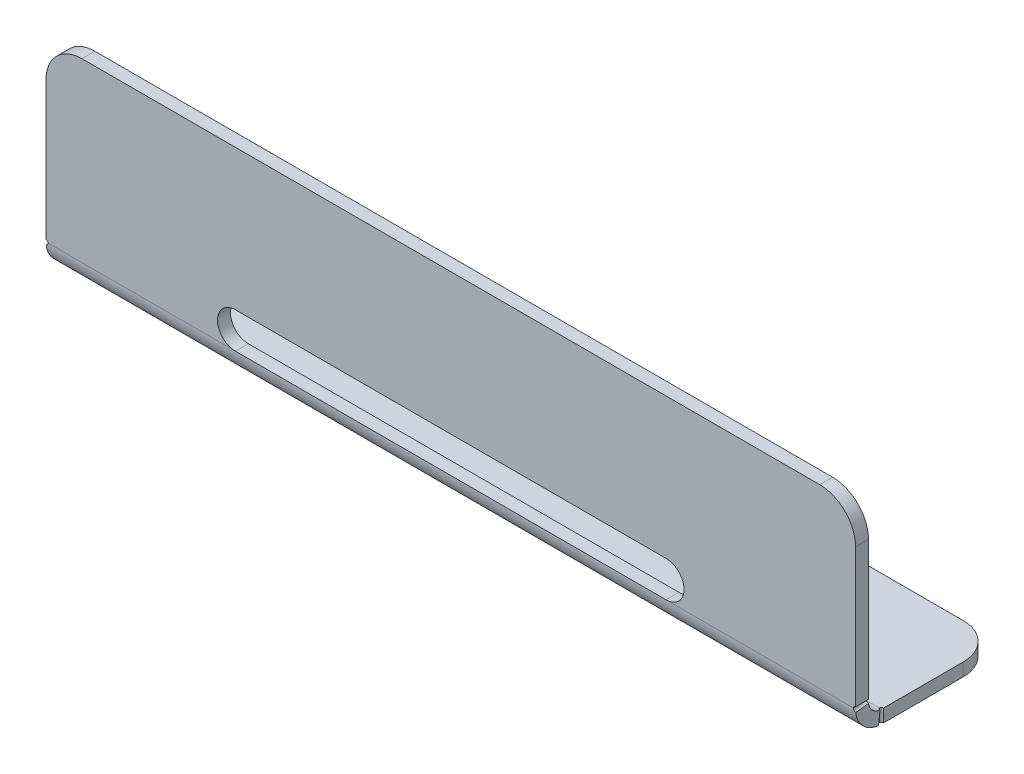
ISO-10303-21;
HEADER;
FILE_DESCRIPTION(('STEP AP214'),'2;1');
FILE_NAME('part.step','',(''),(''),'','','');
FILE_SCHEMA(('AUTOMOTIVE_DESIGN { 1 0 10303 214 1 1 1 1 }'));
ENDSEC;
DATA;
#1=APPLICATION_CONTEXT('core data for automotive mechanical design processes');
#2=APPLICATION_PROTOCOL_DEFINITION('international standard','automotive_design',2000,#1);
#3=PRODUCT_CONTEXT('',#1,'mechanical');
#4=PRODUCT('Part','Part','',(#3));
#5=PRODUCT_RELATED_PRODUCT_CATEGORY('part','',(#4));
#6=PRODUCT_DEFINITION_FORMATION('','',#4);
#7=PRODUCT_DEFINITION_CONTEXT('part definition',#1,'design');
#8=PRODUCT_DEFINITION('design','',#6,#7);
#9=PRODUCT_DEFINITION_SHAPE('','',#8);
#10=(LENGTH_UNIT() NAMED_UNIT(*) SI_UNIT(.MILLI.,.METRE.));
#11=(NAMED_UNIT(*) PLANE_ANGLE_UNIT() SI_UNIT($,.RADIAN.));
#12=(NAMED_UNIT(*) SI_UNIT($,.STERADIAN.) SOLID_ANGLE_UNIT());
#13=UNCERTAINTY_MEASURE_WITH_UNIT(LENGTH_MEASURE(1.E-05),#10,'distance_accuracy_value','');
#14=(GEOMETRIC_REPRESENTATION_CONTEXT(3) GLOBAL_UNCERTAINTY_ASSIGNED_CONTEXT((#13)) GLOBAL_UNIT_ASSIGNED_CONTEXT((#10,
#11,#12)) REPRESENTATION_CONTEXT('',''));
#15=CARTESIAN_POINT('',(0.,0.,0.));
#16=DIRECTION('',(0.,0.,1.));
#17=DIRECTION('',(1.,0.,0.));
#18=AXIS2_PLACEMENT_3D('',#15,#16,#17);
#19=CARTESIAN_POINT('',(0.,2.28600000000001,0.));
#20=DIRECTION('',(0.,-1.,0.));
#21=DIRECTION('',(0.,0.,-1.));
#22=AXIS2_PLACEMENT_3D('',#19,#20,#21);
#23=PLANE('',#22);
#24=CARTESIAN_POINT('',(71.6280000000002,2.28599999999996,-13.97));
#25=DIRECTION('',(0.,1.,0.));
#26=DIRECTION('',(0.,0.,1.));
#27=AXIS2_PLACEMENT_3D('',#24,#25,#26);
#28=CIRCLE('',#27,2.54000000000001);
#29=CARTESIAN_POINT('',(71.6280000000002,2.28599999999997,-11.43));
#30=VERTEX_POINT('',#29);
#31=EDGE_CURVE('E817',#30,#30,#28,.T.);
#32=ORIENTED_EDGE('',*,*,#31,.F.);
#33=EDGE_LOOP('',(#32));
#34=FACE_BOUND('',#33,.T.);
#35=CARTESIAN_POINT('',(122.428,2.28599999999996,-13.97));
#36=DIRECTION('',(0.,1.,0.));
#37=DIRECTION('',(0.,0.,1.));
#38=AXIS2_PLACEMENT_3D('',#35,#36,#37);
#39=CIRCLE('',#38,2.54000000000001);
#40=CARTESIAN_POINT('',(122.428,2.28599999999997,-11.43));
#41=VERTEX_POINT('',#40);
#42=EDGE_CURVE('E811',#41,#41,#39,.T.);
#43=ORIENTED_EDGE('',*,*,#42,.F.);
#44=EDGE_LOOP('',(#43));
#45=FACE_BOUND('',#44,.T.);
#46=CARTESIAN_POINT('',(20.8280000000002,2.28599999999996,-13.97));
#47=DIRECTION('',(0.,1.,0.));
#48=DIRECTION('',(0.,0.,1.));
#49=AXIS2_PLACEMENT_3D('',#46,#47,#48);
#50=CIRCLE('',#49,2.54000000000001);
#51=CARTESIAN_POINT('',(20.8280000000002,2.28599999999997,-11.43));
#52=VERTEX_POINT('',#51);
#53=EDGE_CURVE('E805',#52,#52,#50,.T.);
#54=ORIENTED_EDGE('',*,*,#53,.F.);
#55=EDGE_LOOP('',(#54));
#56=FACE_BOUND('',#55,.T.);
#57=CARTESIAN_POINT('',(0.,2.28599999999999,-4.57199999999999));
#58=DIRECTION('',(0.,1.,0.));
#59=DIRECTION('',(-1.,0.,0.));
#60=AXIS2_PLACEMENT_3D('',#57,#58,#59);
#61=CIRCLE('',#60,0.381000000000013);
#62=CARTESIAN_POINT('',(0.38100000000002,2.28599999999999,-4.57200000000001));
#63=VERTEX_POINT('',#62);
#64=CARTESIAN_POINT('',(0.,2.286,-4.953));
#65=VERTEX_POINT('',#64);
#66=EDGE_CURVE('E371',#63,#65,#61,.T.);
#67=ORIENTED_EDGE('',*,*,#66,.F.);
#68=DIRECTION('',(-1.,0.,0.));
#69=VECTOR('',#68,1.);
#70=CARTESIAN_POINT('',(143.256,2.28599999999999,-4.57200000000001));
#71=LINE('',#70,#69);
#72=CARTESIAN_POINT('',(142.875,2.28599999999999,-4.57200000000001));
#73=VERTEX_POINT('',#72);
#74=EDGE_CURVE('E378',#73,#63,#71,.T.);
#75=ORIENTED_EDGE('',*,*,#74,.F.);
#76=CARTESIAN_POINT('',(143.256,2.28599999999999,-4.57200000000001));
#77=DIRECTION('',(0.,1.,0.));
#78=DIRECTION('',(-1.,0.,0.));
#79=AXIS2_PLACEMENT_3D('',#76,#77,#78);
#80=CIRCLE('',#79,0.38100000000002);
#81=CARTESIAN_POINT('',(143.256,2.286,-4.95300000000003));
#82=VERTEX_POINT('',#81);
#83=EDGE_CURVE('E802',#82,#73,#80,.T.);
#84=ORIENTED_EDGE('',*,*,#83,.F.);
#85=DIRECTION('',(0.,0.,1.));
#86=VECTOR('',#85,1.);
#87=CARTESIAN_POINT('',(143.256,2.28600000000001,0.));
#88=LINE('',#87,#86);
#89=CARTESIAN_POINT('',(143.256,2.28599999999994,-19.05));
#90=VERTEX_POINT('',#89);
#91=EDGE_CURVE('E823',#82,#90,#88,.F.);
#92=ORIENTED_EDGE('',*,*,#91,.T.);
#93=CARTESIAN_POINT('',(136.906,2.28599999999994,-19.05));
#94=DIRECTION('',(0.,-1.,0.));
#95=DIRECTION('',(0.,0.,-1.));
#96=AXIS2_PLACEMENT_3D('',#93,#94,#95);
#97=CIRCLE('',#96,6.35);
#98=CARTESIAN_POINT('',(136.906,2.28599999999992,-25.4));
#99=VERTEX_POINT('',#98);
#100=EDGE_CURVE('E842',#90,#99,#97,.F.);
#101=ORIENTED_EDGE('',*,*,#100,.T.);
#102=DIRECTION('',(1.,0.,0.));
#103=VECTOR('',#102,1.);
#104=CARTESIAN_POINT('',(0.,2.28599999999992,-25.4));
#105=LINE('',#104,#103);
#106=CARTESIAN_POINT('',(6.35,2.28599999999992,-25.4));
#107=VERTEX_POINT('',#106);
#108=EDGE_CURVE('E834',#99,#107,#105,.F.);
#109=ORIENTED_EDGE('',*,*,#108,.T.);
#110=CARTESIAN_POINT('',(6.35,2.28599999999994,-19.05));
#111=DIRECTION('',(0.,-1.,0.));
#112=DIRECTION('',(0.,0.,-1.));
#113=AXIS2_PLACEMENT_3D('',#110,#111,#112);
#114=CIRCLE('',#113,6.35);
#115=CARTESIAN_POINT('',(0.,2.28599999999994,-19.05));
#116=VERTEX_POINT('',#115);
#117=EDGE_CURVE('E844',#107,#116,#114,.F.);
#118=ORIENTED_EDGE('',*,*,#117,.T.);
#119=DIRECTION('',(0.,0.,-1.));
#120=VECTOR('',#119,1.);
#121=CARTESIAN_POINT('',(0.,2.28600000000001,0.));
#122=LINE('',#121,#120);
#123=EDGE_CURVE('E386',#116,#65,#122,.F.);
#124=ORIENTED_EDGE('',*,*,#123,.T.);
#125=EDGE_LOOP('',(#67,#75,#84,#92,#101,#109,#118,#124));
#126=FACE_BOUND('',#125,.T.);
#127=ADVANCED_FACE('F86',(#34,#45,#56,#126),#23,.F.);
#128=CARTESIAN_POINT('',(0.,0.,0.));
#129=DIRECTION('',(0.,-1.,0.));
#130=DIRECTION('',(0.,0.,-1.));
#131=AXIS2_PLACEMENT_3D('',#128,#129,#130);
#132=PLANE('',#131);
#133=CARTESIAN_POINT('',(0.,-2.94662100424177E-13,-4.57199999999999));
#134=DIRECTION('',(0.,1.,0.));
#135=DIRECTION('',(-1.,0.,0.));
#136=AXIS2_PLACEMENT_3D('',#133,#134,#135);
#137=CIRCLE('',#136,0.381000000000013);
#138=CARTESIAN_POINT('',(0.381000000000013,-2.94662100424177E-13,-4.572));
#139=VERTEX_POINT('',#138);
#140=CARTESIAN_POINT('',(0.,-2.93331846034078E-13,-4.95300000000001));
#141=VERTEX_POINT('',#140);
#142=EDGE_CURVE('E112',#139,#141,#137,.T.);
#143=ORIENTED_EDGE('',*,*,#142,.T.);
#144=DIRECTION('',(0.,0.,1.));
#145=VECTOR('',#144,1.);
#146=CARTESIAN_POINT('',(0.,0.,-2.28600000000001));
#147=LINE('',#146,#145);
#148=CARTESIAN_POINT('',(0.,0.,-19.05));
#149=VERTEX_POINT('',#148);
#150=EDGE_CURVE('E824',#149,#141,#147,.T.);
#151=ORIENTED_EDGE('',*,*,#150,.F.);
#152=CARTESIAN_POINT('',(6.35,0.,-19.05));
#153=DIRECTION('',(0.,-1.,0.));
#154=DIRECTION('',(0.,0.,-1.));
#155=AXIS2_PLACEMENT_3D('',#152,#153,#154);
#156=CIRCLE('',#155,6.35);
#157=CARTESIAN_POINT('',(6.35,0.,-25.4));
#158=VERTEX_POINT('',#157);
#159=EDGE_CURVE('E851',#149,#158,#156,.T.);
#160=ORIENTED_EDGE('',*,*,#159,.T.);
#161=DIRECTION('',(-1.,0.,0.));
#162=VECTOR('',#161,1.);
#163=CARTESIAN_POINT('',(0.,0.,-25.4));
#164=LINE('',#163,#162);
#165=CARTESIAN_POINT('',(136.906,0.,-25.4));
#166=VERTEX_POINT('',#165);
#167=EDGE_CURVE('E828',#166,#158,#164,.T.);
#168=ORIENTED_EDGE('',*,*,#167,.F.);
#169=CARTESIAN_POINT('',(136.906,0.,-19.05));
#170=DIRECTION('',(0.,-1.,0.));
#171=DIRECTION('',(0.,0.,-1.));
#172=AXIS2_PLACEMENT_3D('',#169,#170,#171);
#173=CIRCLE('',#172,6.35);
#174=CARTESIAN_POINT('',(143.256,0.,-19.05));
#175=VERTEX_POINT('',#174);
#176=EDGE_CURVE('E848',#166,#175,#173,.T.);
#177=ORIENTED_EDGE('',*,*,#176,.T.);
#178=DIRECTION('',(0.,0.,-1.));
#179=VECTOR('',#178,1.);
#180=CARTESIAN_POINT('',(143.256,0.,-25.4));
#181=LINE('',#180,#179);
#182=CARTESIAN_POINT('',(143.256,-2.93331846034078E-13,-4.95300000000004));
#183=VERTEX_POINT('',#182);
#184=EDGE_CURVE('E831',#183,#175,#181,.T.);
#185=ORIENTED_EDGE('',*,*,#184,.F.);
#186=CARTESIAN_POINT('',(143.256,-2.94662100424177E-13,-4.57200000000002));
#187=DIRECTION('',(0.,1.,0.));
#188=DIRECTION('',(-1.,0.,0.));
#189=AXIS2_PLACEMENT_3D('',#186,#187,#188);
#190=CIRCLE('',#189,0.38100000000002);
#191=CARTESIAN_POINT('',(142.875,-2.94662100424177E-13,-4.572));
#192=VERTEX_POINT('',#191);
#193=EDGE_CURVE('E104',#183,#192,#190,.T.);
#194=ORIENTED_EDGE('',*,*,#193,.T.);
#195=DIRECTION('',(-1.,0.,0.));
#196=VECTOR('',#195,1.);
#197=CARTESIAN_POINT('',(0.,0.,-4.572));
#198=LINE('',#197,#196);
#199=EDGE_CURVE('E97',#192,#139,#198,.T.);
#200=ORIENTED_EDGE('',*,*,#199,.T.);
#201=EDGE_LOOP('',(#143,#151,#160,#168,#177,#185,#194,#200));
#202=FACE_BOUND('',#201,.T.);
#203=CARTESIAN_POINT('',(71.6280000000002,-1.26310783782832E-13,-13.97));
#204=DIRECTION('',(0.,1.,0.));
#205=DIRECTION('',(0.,0.,1.));
#206=AXIS2_PLACEMENT_3D('',#203,#204,#205);
#207=CIRCLE('',#206,2.54000000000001);
#208=CARTESIAN_POINT('',(71.6280000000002,-1.17442421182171E-13,-11.43));
#209=VERTEX_POINT('',#208);
#210=EDGE_CURVE('E820',#209,#209,#207,.T.);
#211=ORIENTED_EDGE('',*,*,#210,.T.);
#212=EDGE_LOOP('',(#211));
#213=FACE_BOUND('',#212,.T.);
#214=CARTESIAN_POINT('',(122.428,-1.26310783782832E-13,-13.97));
#215=DIRECTION('',(0.,1.,0.));
#216=DIRECTION('',(0.,0.,1.));
#217=AXIS2_PLACEMENT_3D('',#214,#215,#216);
#218=CIRCLE('',#217,2.54000000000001);
#219=CARTESIAN_POINT('',(122.428,-1.17442421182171E-13,-11.43));
#220=VERTEX_POINT('',#219);
#221=EDGE_CURVE('E814',#220,#220,#218,.T.);
#222=ORIENTED_EDGE('',*,*,#221,.T.);
#223=EDGE_LOOP('',(#222));
#224=FACE_BOUND('',#223,.T.);
#225=CARTESIAN_POINT('',(20.8280000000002,-1.26310783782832E-13,-13.97));
#226=DIRECTION('',(0.,1.,0.));
#227=DIRECTION('',(0.,0.,1.));
#228=AXIS2_PLACEMENT_3D('',#225,#226,#227);
#229=CIRCLE('',#228,2.54000000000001);
#230=CARTESIAN_POINT('',(20.8280000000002,-1.17442421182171E-13,-11.43));
#231=VERTEX_POINT('',#230);
#232=EDGE_CURVE('E808',#231,#231,#229,.T.);
#233=ORIENTED_EDGE('',*,*,#232,.T.);
#234=EDGE_LOOP('',(#233));
#235=FACE_BOUND('',#234,.T.);
#236=ADVANCED_FACE('F332',(#202,#213,#224,#235),#132,.T.);
#237=CARTESIAN_POINT('',(0.,0.,-2.28600000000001));
#238=DIRECTION('',(-1.,0.,0.));
#239=DIRECTION('',(0.,0.,1.));
#240=AXIS2_PLACEMENT_3D('',#237,#238,#239);
#241=PLANE('',#240);
#242=DIRECTION('',(0.,1.,0.));
#243=VECTOR('',#242,1.);
#244=CARTESIAN_POINT('',(0.,2.28599999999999,-4.953));
#245=LINE('',#244,#243);
#246=EDGE_CURVE('E800',#65,#141,#245,.F.);
#247=ORIENTED_EDGE('',*,*,#246,.F.);
#248=ORIENTED_EDGE('',*,*,#123,.F.);
#249=DIRECTION('',(0.,1.,0.));
#250=VECTOR('',#249,1.);
#251=CARTESIAN_POINT('',(0.,0.,-19.05));
#252=LINE('',#251,#250);
#253=EDGE_CURVE('E846',#116,#149,#252,.F.);
#254=ORIENTED_EDGE('',*,*,#253,.T.);
#255=ORIENTED_EDGE('',*,*,#150,.T.);
#256=EDGE_LOOP('',(#247,#248,#254,#255));
#257=FACE_BOUND('',#256,.T.);
#258=ADVANCED_FACE('F335',(#257),#241,.T.);
#259=CARTESIAN_POINT('',(143.256,0.,-25.4));
#260=DIRECTION('',(1.,0.,0.));
#261=DIRECTION('',(0.,0.,-1.));
#262=AXIS2_PLACEMENT_3D('',#259,#260,#261);
#263=PLANE('',#262);
#264=DIRECTION('',(0.,1.,0.));
#265=VECTOR('',#264,1.);
#266=CARTESIAN_POINT('',(143.256,2.28599999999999,-4.95300000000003));
#267=LINE('',#266,#265);
#268=EDGE_CURVE('E803',#183,#82,#267,.T.);
#269=ORIENTED_EDGE('',*,*,#268,.F.);
#270=ORIENTED_EDGE('',*,*,#184,.T.);
#271=DIRECTION('',(0.,1.,0.));
#272=VECTOR('',#271,1.);
#273=CARTESIAN_POINT('',(143.256,0.,-19.05));
#274=LINE('',#273,#272);
#275=EDGE_CURVE('E397',#175,#90,#274,.T.);
#276=ORIENTED_EDGE('',*,*,#275,.T.);
#277=ORIENTED_EDGE('',*,*,#91,.F.);
#278=EDGE_LOOP('',(#269,#270,#276,#277));
#279=FACE_BOUND('',#278,.T.);
#280=ADVANCED_FACE('F341',(#279),#263,.T.);
#281=CARTESIAN_POINT('',(0.,0.,-25.4));
#282=DIRECTION('',(0.,0.,-1.));
#283=DIRECTION('',(0.,1.,0.));
#284=AXIS2_PLACEMENT_3D('',#281,#282,#283);
#285=PLANE('',#284);
#286=ORIENTED_EDGE('',*,*,#167,.T.);
#287=DIRECTION('',(0.,1.,0.));
#288=VECTOR('',#287,1.);
#289=CARTESIAN_POINT('',(6.35,0.,-25.4));
#290=LINE('',#289,#288);
#291=EDGE_CURVE('E839',#158,#107,#290,.T.);
#292=ORIENTED_EDGE('',*,*,#291,.T.);
#293=ORIENTED_EDGE('',*,*,#108,.F.);
#294=DIRECTION('',(0.,1.,0.));
#295=VECTOR('',#294,1.);
#296=CARTESIAN_POINT('',(136.906,0.,-25.4));
#297=LINE('',#296,#295);
#298=EDGE_CURVE('E827',#99,#166,#297,.F.);
#299=ORIENTED_EDGE('',*,*,#298,.T.);
#300=EDGE_LOOP('',(#286,#292,#293,#299));
#301=FACE_BOUND('',#300,.T.);
#302=ADVANCED_FACE('F343',(#301),#285,.T.);
#303=CARTESIAN_POINT('',(6.35,0.,-19.05));
#304=DIRECTION('',(0.,1.,0.));
#305=DIRECTION('',(0.,0.,1.));
#306=AXIS2_PLACEMENT_3D('',#303,#304,#305);
#307=CYLINDRICAL_SURFACE('',#306,6.35);
#308=ORIENTED_EDGE('',*,*,#159,.F.);
#309=ORIENTED_EDGE('',*,*,#253,.F.);
#310=ORIENTED_EDGE('',*,*,#117,.F.);
#311=ORIENTED_EDGE('',*,*,#291,.F.);
#312=EDGE_LOOP('',(#308,#309,#310,#311));
#313=FACE_BOUND('',#312,.T.);
#314=ADVANCED_FACE('F346',(#313),#307,.T.);
#315=CARTESIAN_POINT('',(136.906,0.,-19.05));
#316=DIRECTION('',(0.,1.,0.));
#317=DIRECTION('',(0.,0.,1.));
#318=AXIS2_PLACEMENT_3D('',#315,#316,#317);
#319=CYLINDRICAL_SURFACE('',#318,6.35);
#320=ORIENTED_EDGE('',*,*,#176,.F.);
#321=ORIENTED_EDGE('',*,*,#298,.F.);
#322=ORIENTED_EDGE('',*,*,#100,.F.);
#323=ORIENTED_EDGE('',*,*,#275,.F.);
#324=EDGE_LOOP('',(#320,#321,#322,#323));
#325=FACE_BOUND('',#324,.T.);
#326=ADVANCED_FACE('F330',(#325),#319,.T.);
#327=CARTESIAN_POINT('',(71.6280000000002,2.28599999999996,-13.97));
#328=DIRECTION('',(0.,1.,0.));
#329=DIRECTION('',(0.,0.,1.));
#330=AXIS2_PLACEMENT_3D('',#327,#328,#329);
#331=CYLINDRICAL_SURFACE('',#330,2.54000000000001);
#332=ORIENTED_EDGE('',*,*,#210,.F.);
#333=EDGE_LOOP('',(#332));
#334=FACE_BOUND('',#333,.T.);
#335=ORIENTED_EDGE('',*,*,#31,.T.);
#336=EDGE_LOOP('',(#335));
#337=FACE_BOUND('',#336,.T.);
#338=ADVANCED_FACE('F326',(#334,#337),#331,.F.);
#339=CARTESIAN_POINT('',(122.428,2.28599999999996,-13.97));
#340=DIRECTION('',(0.,1.,0.));
#341=DIRECTION('',(0.,0.,1.));
#342=AXIS2_PLACEMENT_3D('',#339,#340,#341);
#343=CYLINDRICAL_SURFACE('',#342,2.54000000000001);
#344=ORIENTED_EDGE('',*,*,#221,.F.);
#345=EDGE_LOOP('',(#344));
#346=FACE_BOUND('',#345,.T.);
#347=ORIENTED_EDGE('',*,*,#42,.T.);
#348=EDGE_LOOP('',(#347));
#349=FACE_BOUND('',#348,.T.);
#350=ADVANCED_FACE('F322',(#346,#349),#343,.F.);
#351=CARTESIAN_POINT('',(20.8280000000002,2.28599999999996,-13.97));
#352=DIRECTION('',(0.,1.,0.));
#353=DIRECTION('',(0.,0.,1.));
#354=AXIS2_PLACEMENT_3D('',#351,#352,#353);
#355=CYLINDRICAL_SURFACE('',#354,2.54000000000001);
#356=ORIENTED_EDGE('',*,*,#232,.F.);
#357=EDGE_LOOP('',(#356));
#358=FACE_BOUND('',#357,.T.);
#359=ORIENTED_EDGE('',*,*,#53,.T.);
#360=EDGE_LOOP('',(#359));
#361=FACE_BOUND('',#360,.T.);
#362=ADVANCED_FACE('F319',(#358,#361),#355,.F.);
#363=CARTESIAN_POINT('',(143.256,2.28599999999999,-4.57200000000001));
#364=DIRECTION('',(0.,1.,0.));
#365=DIRECTION('',(-1.,0.,0.));
#366=AXIS2_PLACEMENT_3D('',#363,#364,#365);
#367=CYLINDRICAL_SURFACE('',#366,0.38100000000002);
#368=CARTESIAN_POINT('',(142.875,0.,-4.57200000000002));
#369=CARTESIAN_POINT('',(142.875,2.28599999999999,-4.57200000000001));
#370=B_SPLINE_CURVE_WITH_KNOTS('',1,(#368,#369),.UNSPECIFIED.,.F.,.F.,(2,2),(0.,1.),.UNSPECIFIED.);
#371=EDGE_CURVE('E13',#192,#73,#370,.T.);
#372=ORIENTED_EDGE('',*,*,#371,.F.);
#373=ORIENTED_EDGE('',*,*,#193,.F.);
#374=ORIENTED_EDGE('',*,*,#268,.T.);
#375=ORIENTED_EDGE('',*,*,#83,.T.);
#376=EDGE_LOOP('',(#372,#373,#374,#375));
#377=FACE_BOUND('',#376,.T.);
#378=ADVANCED_FACE('F88',(#377),#367,.F.);
#379=CARTESIAN_POINT('',(0.,2.28599999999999,-4.57199999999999));
#380=DIRECTION('',(0.,1.,0.));
#381=DIRECTION('',(-1.,0.,0.));
#382=AXIS2_PLACEMENT_3D('',#379,#380,#381);
#383=CYLINDRICAL_SURFACE('',#382,0.381000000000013);
#384=CARTESIAN_POINT('',(0.38100000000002,2.28599999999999,-4.57200000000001));
#385=CARTESIAN_POINT('',(0.38100000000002,0.,-4.57200000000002));
#386=B_SPLINE_CURVE_WITH_KNOTS('',1,(#384,#385),.UNSPECIFIED.,.F.,.F.,(2,2),(0.,1.),.UNSPECIFIED.);
#387=EDGE_CURVE('E369',#63,#139,#386,.T.);
#388=ORIENTED_EDGE('',*,*,#387,.F.);
#389=ORIENTED_EDGE('',*,*,#66,.T.);
#390=ORIENTED_EDGE('',*,*,#246,.T.);
#391=ORIENTED_EDGE('',*,*,#142,.F.);
#392=EDGE_LOOP('',(#388,#389,#390,#391));
#393=FACE_BOUND('',#392,.T.);
#394=ADVANCED_FACE('F356',(#393),#383,.F.);
#395=CARTESIAN_POINT('',(143.256,0.,-2.286));
#396=DIRECTION('',(1.,0.,0.));
#397=DIRECTION('',(0.,0.,-1.));
#398=AXIS2_PLACEMENT_3D('',#395,#396,#397);
#399=PLANE('',#398);
#400=DIRECTION('',(0.,0.,-1.));
#401=VECTOR('',#400,1.);
#402=CARTESIAN_POINT('',(143.256,4.95300000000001,-2.286));
#403=LINE('',#402,#401);
#404=CARTESIAN_POINT('',(143.256,4.95300000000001,-2.286));
#405=VERTEX_POINT('',#404);
#406=CARTESIAN_POINT('',(143.256,4.95300000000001,2.8796409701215E-13));
#407=VERTEX_POINT('',#406);
#408=EDGE_CURVE('E289',#405,#407,#403,.F.);
#409=ORIENTED_EDGE('',*,*,#408,.F.);
#410=DIRECTION('',(0.,1.,0.));
#411=VECTOR('',#410,1.);
#412=CARTESIAN_POINT('',(143.256,0.,-2.286));
#413=LINE('',#412,#411);
#414=CARTESIAN_POINT('',(143.256,29.464,-2.286));
#415=VERTEX_POINT('',#414);
#416=EDGE_CURVE('E286',#405,#415,#413,.T.);
#417=ORIENTED_EDGE('',*,*,#416,.T.);
#418=DIRECTION('',(0.,0.,1.));
#419=VECTOR('',#418,1.);
#420=CARTESIAN_POINT('',(143.256,29.464,-2.286));
#421=LINE('',#420,#419);
#422=CARTESIAN_POINT('',(143.256,29.464,0.));
#423=VERTEX_POINT('',#422);
#424=EDGE_CURVE('E739',#415,#423,#421,.T.);
#425=ORIENTED_EDGE('',*,*,#424,.T.);
#426=DIRECTION('',(0.,1.,0.));
#427=VECTOR('',#426,1.);
#428=CARTESIAN_POINT('',(143.256,0.,0.));
#429=LINE('',#428,#427);
#430=EDGE_CURVE('E710',#407,#423,#429,.T.);
#431=ORIENTED_EDGE('',*,*,#430,.F.);
#432=EDGE_LOOP('',(#409,#417,#425,#431));
#433=FACE_BOUND('',#432,.T.);
#434=ADVANCED_FACE('F359',(#433),#399,.T.);
#435=CARTESIAN_POINT('',(136.906,29.464,-2.286));
#436=DIRECTION('',(0.,0.,1.));
#437=DIRECTION('',(1.,0.,0.));
#438=AXIS2_PLACEMENT_3D('',#435,#436,#437);
#439=CYLINDRICAL_SURFACE('',#438,6.35);
#440=CARTESIAN_POINT('',(136.906,29.464,-2.286));
#441=DIRECTION('',(0.,0.,-1.));
#442=DIRECTION('',(-1.,0.,0.));
#443=AXIS2_PLACEMENT_3D('',#440,#441,#442);
#444=CIRCLE('',#443,6.35);
#445=CARTESIAN_POINT('',(136.906,35.814,-2.286));
#446=VERTEX_POINT('',#445);
#447=EDGE_CURVE('E715',#446,#415,#444,.T.);
#448=ORIENTED_EDGE('',*,*,#447,.F.);
#449=DIRECTION('',(0.,0.,1.));
#450=VECTOR('',#449,1.);
#451=CARTESIAN_POINT('',(136.906,35.814,-2.286));
#452=LINE('',#451,#450);
#453=CARTESIAN_POINT('',(136.906,35.814,0.));
#454=VERTEX_POINT('',#453);
#455=EDGE_CURVE('E731',#454,#446,#452,.F.);
#456=ORIENTED_EDGE('',*,*,#455,.F.);
#457=CARTESIAN_POINT('',(136.906,29.464,0.));
#458=DIRECTION('',(0.,0.,-1.));
#459=DIRECTION('',(-1.,0.,0.));
#460=AXIS2_PLACEMENT_3D('',#457,#458,#459);
#461=CIRCLE('',#460,6.35);
#462=EDGE_CURVE('E708',#423,#454,#461,.F.);
#463=ORIENTED_EDGE('',*,*,#462,.F.);
#464=ORIENTED_EDGE('',*,*,#424,.F.);
#465=EDGE_LOOP('',(#448,#456,#463,#464));
#466=FACE_BOUND('',#465,.T.);
#467=ADVANCED_FACE('F364',(#466),#439,.T.);
#468=CARTESIAN_POINT('',(0.,35.814,-2.286));
#469=DIRECTION('',(0.,1.,0.));
#470=DIRECTION('',(-1.,0.,0.));
#471=AXIS2_PLACEMENT_3D('',#468,#469,#470);
#472=PLANE('',#471);
#473=DIRECTION('',(-1.,0.,0.));
#474=VECTOR('',#473,1.);
#475=CARTESIAN_POINT('',(0.,35.814,-2.286));
#476=LINE('',#475,#474);
#477=CARTESIAN_POINT('',(6.35,35.814,-2.286));
#478=VERTEX_POINT('',#477);
#479=EDGE_CURVE('E736',#446,#478,#476,.T.);
#480=ORIENTED_EDGE('',*,*,#479,.T.);
#481=DIRECTION('',(0.,0.,1.));
#482=VECTOR('',#481,1.);
#483=CARTESIAN_POINT('',(6.35,35.814,-2.286));
#484=LINE('',#483,#482);
#485=CARTESIAN_POINT('',(6.35,35.814,0.));
#486=VERTEX_POINT('',#485);
#487=EDGE_CURVE('E733',#478,#486,#484,.T.);
#488=ORIENTED_EDGE('',*,*,#487,.T.);
#489=DIRECTION('',(-1.,0.,0.));
#490=VECTOR('',#489,1.);
#491=CARTESIAN_POINT('',(0.,35.814,0.));
#492=LINE('',#491,#490);
#493=EDGE_CURVE('E705',#454,#486,#492,.T.);
#494=ORIENTED_EDGE('',*,*,#493,.F.);
#495=ORIENTED_EDGE('',*,*,#455,.T.);
#496=EDGE_LOOP('',(#480,#488,#494,#495));
#497=FACE_BOUND('',#496,.T.);
#498=ADVANCED_FACE('F912',(#497),#472,.T.);
#499=CARTESIAN_POINT('',(6.35,29.464,-2.286));
#500=DIRECTION('',(0.,0.,1.));
#501=DIRECTION('',(1.,0.,0.));
#502=AXIS2_PLACEMENT_3D('',#499,#500,#501);
#503=CYLINDRICAL_SURFACE('',#502,6.35);
#504=CARTESIAN_POINT('',(6.35,29.464,-2.286));
#505=DIRECTION('',(0.,0.,-1.));
#506=DIRECTION('',(-1.,0.,0.));
#507=AXIS2_PLACEMENT_3D('',#504,#505,#506);
#508=CIRCLE('',#507,6.35);
#509=CARTESIAN_POINT('',(0.,29.464,-2.286));
#510=VERTEX_POINT('',#509);
#511=EDGE_CURVE('E717',#510,#478,#508,.T.);
#512=ORIENTED_EDGE('',*,*,#511,.F.);
#513=DIRECTION('',(0.,0.,1.));
#514=VECTOR('',#513,1.);
#515=CARTESIAN_POINT('',(0.,29.464,-2.286));
#516=LINE('',#515,#514);
#517=CARTESIAN_POINT('',(0.,29.464,0.));
#518=VERTEX_POINT('',#517);
#519=EDGE_CURVE('E729',#518,#510,#516,.F.);
#520=ORIENTED_EDGE('',*,*,#519,.F.);
#521=CARTESIAN_POINT('',(6.35,29.464,0.));
#522=DIRECTION('',(0.,0.,-1.));
#523=DIRECTION('',(-1.,0.,0.));
#524=AXIS2_PLACEMENT_3D('',#521,#522,#523);
#525=CIRCLE('',#524,6.35);
#526=EDGE_CURVE('E703',#486,#518,#525,.F.);
#527=ORIENTED_EDGE('',*,*,#526,.F.);
#528=ORIENTED_EDGE('',*,*,#487,.F.);
#529=EDGE_LOOP('',(#512,#520,#527,#528));
#530=FACE_BOUND('',#529,.T.);
#531=ADVANCED_FACE('F916',(#530),#503,.T.);
#532=CARTESIAN_POINT('',(0.,0.,-2.286));
#533=DIRECTION('',(-1.,0.,0.));
#534=DIRECTION('',(0.,0.,1.));
#535=AXIS2_PLACEMENT_3D('',#532,#533,#534);
#536=PLANE('',#535);
#537=DIRECTION('',(0.,0.,-1.));
#538=VECTOR('',#537,1.);
#539=CARTESIAN_POINT('',(0.,4.953,-2.286));
#540=LINE('',#539,#538);
#541=CARTESIAN_POINT('',(0.,4.953,2.8796409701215E-13));
#542=VERTEX_POINT('',#541);
#543=CARTESIAN_POINT('',(0.,4.953,-2.286));
#544=VERTEX_POINT('',#543);
#545=EDGE_CURVE('E712',#542,#544,#540,.T.);
#546=ORIENTED_EDGE('',*,*,#545,.F.);
#547=DIRECTION('',(0.,-1.,0.));
#548=VECTOR('',#547,1.);
#549=CARTESIAN_POINT('',(0.,0.,0.));
#550=LINE('',#549,#548);
#551=EDGE_CURVE('E699',#518,#542,#550,.T.);
#552=ORIENTED_EDGE('',*,*,#551,.F.);
#553=ORIENTED_EDGE('',*,*,#519,.T.);
#554=DIRECTION('',(0.,-1.,0.));
#555=VECTOR('',#554,1.);
#556=CARTESIAN_POINT('',(0.,0.,-2.286));
#557=LINE('',#556,#555);
#558=EDGE_CURVE('E726',#510,#544,#557,.T.);
#559=ORIENTED_EDGE('',*,*,#558,.T.);
#560=EDGE_LOOP('',(#546,#552,#553,#559));
#561=FACE_BOUND('',#560,.T.);
#562=ADVANCED_FACE('F920',(#561),#536,.T.);
#563=CARTESIAN_POINT('',(33.528,10.922,-2.54));
#564=DIRECTION('',(0.,1.,0.));
#565=DIRECTION('',(-1.,0.,0.));
#566=AXIS2_PLACEMENT_3D('',#563,#564,#565);
#567=PLANE('',#566);
#568=DIRECTION('',(1.,0.,0.));
#569=VECTOR('',#568,1.);
#570=CARTESIAN_POINT('',(0.,10.922,-2.286));
#571=LINE('',#570,#569);
#572=CARTESIAN_POINT('',(33.528,10.922,-2.286));
#573=VERTEX_POINT('',#572);
#574=CARTESIAN_POINT('',(109.728,10.922,-2.286));
#575=VERTEX_POINT('',#574);
#576=EDGE_CURVE('E724',#573,#575,#571,.T.);
#577=ORIENTED_EDGE('',*,*,#576,.T.);
#578=DIRECTION('',(0.,0.,1.));
#579=VECTOR('',#578,1.);
#580=CARTESIAN_POINT('',(109.728,10.922,-2.54));
#581=LINE('',#580,#579);
#582=CARTESIAN_POINT('',(109.728,10.922,0.));
#583=VERTEX_POINT('',#582);
#584=EDGE_CURVE('E722',#575,#583,#581,.T.);
#585=ORIENTED_EDGE('',*,*,#584,.T.);
#586=DIRECTION('',(-1.,0.,0.));
#587=VECTOR('',#586,1.);
#588=CARTESIAN_POINT('',(33.528,10.922,0.));
#589=LINE('',#588,#587);
#590=CARTESIAN_POINT('',(33.528,10.922,0.));
#591=VERTEX_POINT('',#590);
#592=EDGE_CURVE('E719',#583,#591,#589,.T.);
#593=ORIENTED_EDGE('',*,*,#592,.T.);
#594=DIRECTION('',(0.,0.,1.));
#595=VECTOR('',#594,1.);
#596=CARTESIAN_POINT('',(33.528,10.922,-2.54));
#597=LINE('',#596,#595);
#598=EDGE_CURVE('E694',#573,#591,#597,.T.);
#599=ORIENTED_EDGE('',*,*,#598,.F.);
#600=EDGE_LOOP('',(#577,#585,#593,#599));
#601=FACE_BOUND('',#600,.T.);
#602=ADVANCED_FACE('F789',(#601),#567,.F.);
#603=CARTESIAN_POINT('',(0.,0.,-2.286));
#604=DIRECTION('',(0.,0.,-1.));
#605=DIRECTION('',(-1.,0.,0.));
#606=AXIS2_PLACEMENT_3D('',#603,#604,#605);
#607=PLANE('',#606);
#608=CARTESIAN_POINT('',(143.256,4.57199999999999,-2.286));
#609=DIRECTION('',(0.,0.,-1.));
#610=DIRECTION('',(-1.,0.,0.));
#611=AXIS2_PLACEMENT_3D('',#608,#609,#610);
#612=CIRCLE('',#611,0.38100000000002);
#613=CARTESIAN_POINT('',(142.875,4.57199999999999,-2.286));
#614=VERTEX_POINT('',#613);
#615=EDGE_CURVE('E283',#614,#405,#612,.T.);
#616=ORIENTED_EDGE('',*,*,#615,.F.);
#617=DIRECTION('',(1.,0.,0.));
#618=VECTOR('',#617,1.);
#619=CARTESIAN_POINT('',(0.,4.57199999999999,-2.286));
#620=LINE('',#619,#618);
#621=CARTESIAN_POINT('',(109.728,4.572,-2.286));
#622=VERTEX_POINT('',#621);
#623=EDGE_CURVE('E251',#622,#614,#620,.T.);
#624=ORIENTED_EDGE('',*,*,#623,.F.);
#625=CARTESIAN_POINT('',(109.728,7.747,-2.286));
#626=DIRECTION('',(0.,0.,-1.));
#627=DIRECTION('',(-1.,0.,0.));
#628=AXIS2_PLACEMENT_3D('',#625,#626,#627);
#629=CIRCLE('',#628,3.175);
#630=EDGE_CURVE('E689',#575,#622,#629,.T.);
#631=ORIENTED_EDGE('',*,*,#630,.F.);
#632=ORIENTED_EDGE('',*,*,#576,.F.);
#633=CARTESIAN_POINT('',(33.528,7.74699999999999,-2.286));
#634=DIRECTION('',(0.,0.,-1.));
#635=DIRECTION('',(-1.,0.,0.));
#636=AXIS2_PLACEMENT_3D('',#633,#634,#635);
#637=CIRCLE('',#636,3.175);
#638=CARTESIAN_POINT('',(33.528,4.57199999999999,-2.286));
#639=VERTEX_POINT('',#638);
#640=EDGE_CURVE('E696',#639,#573,#637,.T.);
#641=ORIENTED_EDGE('',*,*,#640,.F.);
#642=DIRECTION('',(1.,0.,0.));
#643=VECTOR('',#642,1.);
#644=CARTESIAN_POINT('',(0.,4.57199999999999,-2.286));
#645=LINE('',#644,#643);
#646=CARTESIAN_POINT('',(0.381000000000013,4.57199999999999,-2.286));
#647=VERTEX_POINT('',#646);
#648=EDGE_CURVE('E298',#647,#639,#645,.T.);
#649=ORIENTED_EDGE('',*,*,#648,.F.);
#650=CARTESIAN_POINT('',(0.,4.57199999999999,-2.286));
#651=DIRECTION('',(0.,0.,-1.));
#652=DIRECTION('',(-1.,0.,0.));
#653=AXIS2_PLACEMENT_3D('',#650,#651,#652);
#654=CIRCLE('',#653,0.381000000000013);
#655=EDGE_CURVE('E714',#544,#647,#654,.T.);
#656=ORIENTED_EDGE('',*,*,#655,.F.);
#657=ORIENTED_EDGE('',*,*,#558,.F.);
#658=ORIENTED_EDGE('',*,*,#511,.T.);
#659=ORIENTED_EDGE('',*,*,#479,.F.);
#660=ORIENTED_EDGE('',*,*,#447,.T.);
#661=ORIENTED_EDGE('',*,*,#416,.F.);
#662=EDGE_LOOP('',(#616,#624,#631,#632,#641,#649,#656,#657,#658,#659,#660,#661));
#663=FACE_BOUND('',#662,.T.);
#664=ADVANCED_FACE('F284',(#663),#607,.T.);
#665=CARTESIAN_POINT('',(0.,4.57199999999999,-2.286));
#666=DIRECTION('',(0.,0.,-1.));
#667=DIRECTION('',(-1.,0.,0.));
#668=AXIS2_PLACEMENT_3D('',#665,#666,#667);
#669=CYLINDRICAL_SURFACE('',#668,0.381000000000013);
#670=CARTESIAN_POINT('',(0.38100000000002,4.57199999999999,0.));
#671=CARTESIAN_POINT('',(0.38100000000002,4.57199999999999,-2.286));
#672=B_SPLINE_CURVE_WITH_KNOTS('',1,(#670,#671),.UNSPECIFIED.,.F.,.F.,(2,2),(0.,1.),.UNSPECIFIED.);
#673=CARTESIAN_POINT('',(0.381000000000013,4.57199999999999,2.8796409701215E-13));
#674=VERTEX_POINT('',#673);
#675=EDGE_CURVE('E534',#674,#647,#672,.T.);
#676=ORIENTED_EDGE('',*,*,#675,.F.);
#677=CARTESIAN_POINT('',(0.,4.57199999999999,2.8796409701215E-13));
#678=DIRECTION('',(0.,0.,-1.));
#679=DIRECTION('',(-1.,0.,0.));
#680=AXIS2_PLACEMENT_3D('',#677,#678,#679);
#681=CIRCLE('',#680,0.381000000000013);
#682=EDGE_CURVE('E702',#542,#674,#681,.T.);
#683=ORIENTED_EDGE('',*,*,#682,.F.);
#684=ORIENTED_EDGE('',*,*,#545,.T.);
#685=ORIENTED_EDGE('',*,*,#655,.T.);
#686=EDGE_LOOP('',(#676,#683,#684,#685));
#687=FACE_BOUND('',#686,.T.);
#688=ADVANCED_FACE('F765',(#687),#669,.F.);
#689=CARTESIAN_POINT('',(0.,0.,0.));
#690=DIRECTION('',(0.,0.,-1.));
#691=DIRECTION('',(-1.,0.,0.));
#692=AXIS2_PLACEMENT_3D('',#689,#690,#691);
#693=PLANE('',#692);
#694=DIRECTION('',(1.,0.,0.));
#695=VECTOR('',#694,1.);
#696=CARTESIAN_POINT('',(0.,4.57199999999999,0.));
#697=LINE('',#696,#695);
#698=CARTESIAN_POINT('',(109.728,4.57200000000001,0.));
#699=VERTEX_POINT('',#698);
#700=CARTESIAN_POINT('',(142.875,4.57199999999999,0.));
#701=VERTEX_POINT('',#700);
#702=EDGE_CURVE('E904',#699,#701,#697,.T.);
#703=ORIENTED_EDGE('',*,*,#702,.T.);
#704=CARTESIAN_POINT('',(143.256,4.57199999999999,2.8796409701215E-13));
#705=DIRECTION('',(0.,0.,-1.));
#706=DIRECTION('',(-1.,0.,0.));
#707=AXIS2_PLACEMENT_3D('',#704,#705,#706);
#708=CIRCLE('',#707,0.38100000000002);
#709=EDGE_CURVE('E296',#701,#407,#708,.T.);
#710=ORIENTED_EDGE('',*,*,#709,.T.);
#711=ORIENTED_EDGE('',*,*,#430,.T.);
#712=ORIENTED_EDGE('',*,*,#462,.T.);
#713=ORIENTED_EDGE('',*,*,#493,.T.);
#714=ORIENTED_EDGE('',*,*,#526,.T.);
#715=ORIENTED_EDGE('',*,*,#551,.T.);
#716=ORIENTED_EDGE('',*,*,#682,.T.);
#717=DIRECTION('',(1.,0.,0.));
#718=VECTOR('',#717,1.);
#719=CARTESIAN_POINT('',(0.,4.57199999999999,0.));
#720=LINE('',#719,#718);
#721=CARTESIAN_POINT('',(33.528,4.57199999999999,0.));
#722=VERTEX_POINT('',#721);
#723=EDGE_CURVE('E698',#674,#722,#720,.T.);
#724=ORIENTED_EDGE('',*,*,#723,.T.);
#725=CARTESIAN_POINT('',(33.528,7.74699999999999,0.));
#726=DIRECTION('',(0.,0.,1.));
#727=DIRECTION('',(1.,0.,0.));
#728=AXIS2_PLACEMENT_3D('',#725,#726,#727);
#729=CIRCLE('',#728,3.175);
#730=EDGE_CURVE('E691',#591,#722,#729,.T.);
#731=ORIENTED_EDGE('',*,*,#730,.F.);
#732=ORIENTED_EDGE('',*,*,#592,.F.);
#733=CARTESIAN_POINT('',(109.728,7.747,0.));
#734=DIRECTION('',(0.,0.,1.));
#735=DIRECTION('',(1.,0.,0.));
#736=AXIS2_PLACEMENT_3D('',#733,#734,#735);
#737=CIRCLE('',#736,3.175);
#738=EDGE_CURVE('E290',#699,#583,#737,.T.);
#739=ORIENTED_EDGE('',*,*,#738,.F.);
#740=EDGE_LOOP('',(#703,#710,#711,#712,#713,#714,#715,#716,#724,#731,#732,#739));
#741=FACE_BOUND('',#740,.T.);
#742=ADVANCED_FACE('F775',(#741),#693,.F.);
#743=CARTESIAN_POINT('',(33.528,7.74699999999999,-2.54));
#744=DIRECTION('',(0.,0.,1.));
#745=DIRECTION('',(1.,0.,0.));
#746=AXIS2_PLACEMENT_3D('',#743,#744,#745);
#747=CYLINDRICAL_SURFACE('',#746,3.175);
#748=ORIENTED_EDGE('',*,*,#640,.T.);
#749=ORIENTED_EDGE('',*,*,#598,.T.);
#750=ORIENTED_EDGE('',*,*,#730,.T.);
#751=DIRECTION('',(0.,0.,1.));
#752=VECTOR('',#751,1.);
#753=CARTESIAN_POINT('',(33.528,4.57199999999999,-2.54));
#754=LINE('',#753,#752);
#755=EDGE_CURVE('E743',#639,#722,#754,.T.);
#756=ORIENTED_EDGE('',*,*,#755,.F.);
#757=EDGE_LOOP('',(#748,#749,#750,#756));
#758=FACE_BOUND('',#757,.T.);
#759=ADVANCED_FACE('F778',(#758),#747,.F.);
#760=CARTESIAN_POINT('',(109.728,7.747,-2.54));
#761=DIRECTION('',(0.,0.,1.));
#762=DIRECTION('',(1.,0.,0.));
#763=AXIS2_PLACEMENT_3D('',#760,#761,#762);
#764=CYLINDRICAL_SURFACE('',#763,3.175);
#765=ORIENTED_EDGE('',*,*,#630,.T.);
#766=DIRECTION('',(0.,0.,1.));
#767=VECTOR('',#766,1.);
#768=CARTESIAN_POINT('',(109.728,4.57200000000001,-2.54));
#769=LINE('',#768,#767);
#770=EDGE_CURVE('E686',#622,#699,#769,.T.);
#771=ORIENTED_EDGE('',*,*,#770,.T.);
#772=ORIENTED_EDGE('',*,*,#738,.T.);
#773=ORIENTED_EDGE('',*,*,#584,.F.);
#774=EDGE_LOOP('',(#765,#771,#772,#773));
#775=FACE_BOUND('',#774,.T.);
#776=ADVANCED_FACE('F317',(#775),#764,.F.);
#777=CARTESIAN_POINT('',(143.256,4.57199999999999,-2.286));
#778=DIRECTION('',(0.,0.,-1.));
#779=DIRECTION('',(-1.,0.,0.));
#780=AXIS2_PLACEMENT_3D('',#777,#778,#779);
#781=CYLINDRICAL_SURFACE('',#780,0.38100000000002);
#782=CARTESIAN_POINT('',(142.875,4.57199999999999,-2.286));
#783=CARTESIAN_POINT('',(142.875,4.57199999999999,0.));
#784=B_SPLINE_CURVE_WITH_KNOTS('',1,(#782,#783),.UNSPECIFIED.,.F.,.F.,(2,2),(0.,1.),.UNSPECIFIED.);
#785=EDGE_CURVE('E266',#614,#701,#784,.T.);
#786=ORIENTED_EDGE('',*,*,#785,.F.);
#787=ORIENTED_EDGE('',*,*,#615,.T.);
#788=ORIENTED_EDGE('',*,*,#408,.T.);
#789=ORIENTED_EDGE('',*,*,#709,.F.);
#790=EDGE_LOOP('',(#786,#787,#788,#789));
#791=FACE_BOUND('',#790,.T.);
#792=ADVANCED_FACE('F294',(#791),#781,.F.);
#793=CARTESIAN_POINT('',(71.628,4.57199999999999,-2.286));
#794=DIRECTION('',(0.,-1.,0.));
#795=DIRECTION('',(1.,0.,0.));
#796=AXIS2_PLACEMENT_3D('',#793,#794,#795);
#797=PLANE('',#796);
#798=DIRECTION('',(1.,0.,0.));
#799=VECTOR('',#798,1.);
#800=CARTESIAN_POINT('',(0.38100000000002,4.57199999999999,-2.286));
#801=LINE('',#800,#799);
#802=EDGE_CURVE('E261',#639,#622,#801,.T.);
#803=ORIENTED_EDGE('',*,*,#802,.F.);
#804=ORIENTED_EDGE('',*,*,#755,.T.);
#805=DIRECTION('',(-1.,0.,0.));
#806=VECTOR('',#805,1.);
#807=CARTESIAN_POINT('',(215.003448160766,4.57199999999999,0.));
#808=LINE('',#807,#806);
#809=EDGE_CURVE('E279',#722,#699,#808,.F.);
#810=ORIENTED_EDGE('',*,*,#809,.T.);
#811=ORIENTED_EDGE('',*,*,#770,.F.);
#812=EDGE_LOOP('',(#803,#804,#810,#811));
#813=FACE_BOUND('',#812,.T.);
#814=ADVANCED_FACE('F316',(#813),#797,.F.);
#815=CARTESIAN_POINT('',(142.875,4.57199999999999,0.));
#816=CARTESIAN_POINT('',(142.917148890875,4.29020302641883,0.));
#817=CARTESIAN_POINT('',(143.044160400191,4.12171341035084,-0.021870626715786));
#818=CARTESIAN_POINT('',(143.256,4.06504462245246,-0.0281931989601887));
#819=CARTESIAN_POINT('',(142.875,4.57199999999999,-2.286));
#820=CARTESIAN_POINT('',(142.917149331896,4.43110003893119,-2.286));
#821=CARTESIAN_POINT('',(143.044120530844,4.34686203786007,-2.29693471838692));
#822=CARTESIAN_POINT('',(143.256,4.31852231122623,-2.30009659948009));
#823=B_SPLINE_SURFACE_WITH_KNOTS('',1,3,((#815,#816,#817,#818),(#819,#820,#821,#822)),
.UNSPECIFIED.,.F.,.F.,.F.,(2,2),(4,4),(0.,1.),(0.,1.),.UNSPECIFIED.);
#824=CARTESIAN_POINT('',(142.875,4.57199999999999,0.));
#825=CARTESIAN_POINT('',(142.917148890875,4.29020302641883,0.));
#826=CARTESIAN_POINT('',(143.044160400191,4.12171341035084,-0.021870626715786));
#827=CARTESIAN_POINT('',(143.256,4.06504462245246,-0.0281931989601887));
#828=B_SPLINE_CURVE_WITH_KNOTS('',3,(#824,#825,#826,#827),.UNSPECIFIED.,.F.,.F.,(4,4),(0.,1.),.UNSPECIFIED.);
#829=CARTESIAN_POINT('',(143.256,4.06504462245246,-0.0281931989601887));
#830=VERTEX_POINT('',#829);
#831=EDGE_CURVE('E598',#701,#830,#828,.T.);
#832=CARTESIAN_POINT('',(143.256,4.06504462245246,-0.0281931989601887));
#833=CARTESIAN_POINT('',(143.256,4.31852231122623,-2.30009659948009));
#834=B_SPLINE_CURVE_WITH_KNOTS('',1,(#832,#833),.UNSPECIFIED.,.F.,.F.,(2,2),(0.,1.),.UNSPECIFIED.);
#835=CARTESIAN_POINT('',(143.256,4.31852231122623,-2.30009659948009));
#836=VERTEX_POINT('',#835);
#837=EDGE_CURVE('E267',#830,#836,#834,.T.);
#838=CARTESIAN_POINT('',(143.256,4.31852231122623,-2.30009659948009));
#839=CARTESIAN_POINT('',(143.044120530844,4.34686203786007,-2.29693471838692));
#840=CARTESIAN_POINT('',(142.917149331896,4.43110003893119,-2.286));
#841=CARTESIAN_POINT('',(142.875,4.57199999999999,-2.286));
#842=B_SPLINE_CURVE_WITH_KNOTS('',3,(#838,#839,#840,#841),.UNSPECIFIED.,.F.,.F.,(4,4),(0.,1.),.UNSPECIFIED.);
#843=EDGE_CURVE('E256',#614,#836,#842,.F.);
#844=ORIENTED_EDGE('',*,*,#785,.T.);
#845=ORIENTED_EDGE('',*,*,#831,.T.);
#846=ORIENTED_EDGE('',*,*,#837,.T.);
#847=ORIENTED_EDGE('',*,*,#843,.F.);
#848=EDGE_LOOP('',(#844,#845,#846,#847));
#849=FACE_BOUND('',#848,.T.);
#850=ADVANCED_FACE('F271',(#849),#823,.F.);
#851=CARTESIAN_POINT('',(143.256,4.57199999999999,-4.572));
#852=DIRECTION('',(-1.,0.,0.));
#853=DIRECTION('',(0.,0.,1.));
#854=AXIS2_PLACEMENT_3D('',#851,#852,#853);
#855=PLANE('',#854);
#856=ORIENTED_EDGE('',*,*,#837,.F.);
#857=CARTESIAN_POINT('',(143.256,4.57199999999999,-4.572));
#858=DIRECTION('',(-1.,0.,0.));
#859=DIRECTION('',(0.,0.,1.));
#860=AXIS2_PLACEMENT_3D('',#857,#858,#859);
#861=CIRCLE('',#860,4.572);
#862=CARTESIAN_POINT('',(143.256,0.0281931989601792,-4.06504462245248));
#863=VERTEX_POINT('',#862);
#864=EDGE_CURVE('E610',#830,#863,#861,.F.);
#865=ORIENTED_EDGE('',*,*,#864,.T.);
#866=CARTESIAN_POINT('',(143.256,2.30009659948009,-4.31852231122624));
#867=CARTESIAN_POINT('',(143.256,0.0281931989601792,-4.06504462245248));
#868=B_SPLINE_CURVE_WITH_KNOTS('',1,(#866,#867),.UNSPECIFIED.,.F.,.F.,(2,2),(0.,1.),.UNSPECIFIED.);
#869=CARTESIAN_POINT('',(143.256,2.30009659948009,-4.31852231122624));
#870=VERTEX_POINT('',#869);
#871=EDGE_CURVE('E490',#863,#870,#868,.F.);
#872=ORIENTED_EDGE('',*,*,#871,.T.);
#873=CARTESIAN_POINT('',(143.256,4.57199999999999,-4.572));
#874=DIRECTION('',(1.,0.,0.));
#875=DIRECTION('',(0.,0.,-1.));
#876=AXIS2_PLACEMENT_3D('',#873,#874,#875);
#877=CIRCLE('',#876,2.286);
#878=EDGE_CURVE('E278',#836,#870,#877,.T.);
#879=ORIENTED_EDGE('',*,*,#878,.F.);
#880=EDGE_LOOP('',(#856,#865,#872,#879));
#881=FACE_BOUND('',#880,.T.);
#882=ADVANCED_FACE('F495',(#881),#855,.F.);
#883=CARTESIAN_POINT('',(143.256,0.0281931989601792,-4.06504462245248));
#884=CARTESIAN_POINT('',(143.176337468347,0.027154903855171,-4.07435079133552));
#885=CARTESIAN_POINT('',(143.104754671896,0.0215063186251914,-4.12104578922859));
#886=CARTESIAN_POINT('',(142.977754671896,0.00793001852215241,-4.28983400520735));
#887=CARTESIAN_POINT('',(142.922347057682,0.,-4.41199484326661));
#888=CARTESIAN_POINT('',(142.875,0.,-4.57200000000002));
#889=CARTESIAN_POINT('',(143.256,2.30009659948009,-4.31852231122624));
#890=CARTESIAN_POINT('',(143.17633670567,2.29957744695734,-4.32317544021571));
#891=CARTESIAN_POINT('',(143.104754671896,2.29675315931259,-4.34652289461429));
#892=CARTESIAN_POINT('',(142.977754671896,2.28996500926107,-4.43091700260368));
#893=CARTESIAN_POINT('',(142.922344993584,2.28599999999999,-4.49200090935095));
#894=CARTESIAN_POINT('',(142.875,2.28599999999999,-4.57200000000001));
#895=B_SPLINE_SURFACE_WITH_KNOTS('',1,3,((#883,#884,#885,#886,#887,#888),(#889,#890,#891,#892,
#893,#894)),.UNSPECIFIED.,.F.,.F.,.F.,(2,2),(4,2,4),(0.,1.),(0.,0.5,1.),.UNSPECIFIED.);
#896=CARTESIAN_POINT('',(143.256,0.0281931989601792,-4.06504462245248));
#897=CARTESIAN_POINT('',(143.176337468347,0.027154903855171,-4.07435079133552));
#898=CARTESIAN_POINT('',(143.104754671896,0.0215063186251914,-4.12104578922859));
#899=CARTESIAN_POINT('',(142.977754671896,0.00793001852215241,-4.28983400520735));
#900=CARTESIAN_POINT('',(142.922347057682,0.,-4.41199484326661));
#901=CARTESIAN_POINT('',(142.875,0.,-4.57200000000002));
#902=B_SPLINE_CURVE_WITH_KNOTS('',3,(#896,#897,#898,#899,#900,#901),.UNSPECIFIED.,.F.,.F.,(4,2,
4),(0.,0.5,1.),.UNSPECIFIED.);
#903=EDGE_CURVE('E611',#863,#192,#902,.T.);
#904=CARTESIAN_POINT('',(142.875,2.28599999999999,-4.57200000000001));
#905=CARTESIAN_POINT('',(142.922344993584,2.28599999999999,-4.49200090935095));
#906=CARTESIAN_POINT('',(142.977754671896,2.28996500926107,-4.43091700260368));
#907=CARTESIAN_POINT('',(143.104754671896,2.29675315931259,-4.34652289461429));
#908=CARTESIAN_POINT('',(143.17633670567,2.29957744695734,-4.32317544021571));
#909=CARTESIAN_POINT('',(143.256,2.30009659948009,-4.31852231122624));
#910=B_SPLINE_CURVE_WITH_KNOTS('',3,(#904,#905,#906,#907,#908,#909),.UNSPECIFIED.,.F.,.F.,(4,2,
4),(0.,0.5,1.),.UNSPECIFIED.);
#911=EDGE_CURVE('E395',#870,#73,#910,.F.);
#912=ORIENTED_EDGE('',*,*,#871,.F.);
#913=ORIENTED_EDGE('',*,*,#903,.T.);
#914=ORIENTED_EDGE('',*,*,#371,.T.);
#915=ORIENTED_EDGE('',*,*,#911,.F.);
#916=EDGE_LOOP('',(#912,#913,#914,#915));
#917=FACE_BOUND('',#916,.T.);
#918=ADVANCED_FACE('F428',(#917),#895,.F.);
#919=CARTESIAN_POINT('',(0.38100000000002,0.,-4.57200000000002));
#920=CARTESIAN_POINT('',(0.338851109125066,0.,-4.29020302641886));
#921=CARTESIAN_POINT('',(0.211839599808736,0.0218706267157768,-4.12171341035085));
#922=CARTESIAN_POINT('',(0.,0.0281931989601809,-4.06504462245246));
#923=CARTESIAN_POINT('',(0.38100000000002,2.28599999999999,-4.57200000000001));
#924=CARTESIAN_POINT('',(0.338850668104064,2.28599999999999,-4.43110003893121));
#925=CARTESIAN_POINT('',(0.211879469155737,2.29693471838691,-4.34686203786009));
#926=CARTESIAN_POINT('',(0.,2.30009659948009,-4.31852231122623));
#927=B_SPLINE_SURFACE_WITH_KNOTS('',1,3,((#919,#920,#921,#922),(#923,#924,#925,#926)),
.UNSPECIFIED.,.F.,.F.,.F.,(2,2),(4,4),(0.,1.),(0.,1.),.UNSPECIFIED.);
#928=CARTESIAN_POINT('',(0.38100000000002,0.,-4.57200000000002));
#929=CARTESIAN_POINT('',(0.338851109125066,0.,-4.29020302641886));
#930=CARTESIAN_POINT('',(0.211839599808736,0.0218706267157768,-4.12171341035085));
#931=CARTESIAN_POINT('',(0.,0.0281931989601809,-4.06504462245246));
#932=B_SPLINE_CURVE_WITH_KNOTS('',3,(#928,#929,#930,#931),.UNSPECIFIED.,.F.,.F.,(4,4),(0.,1.),.UNSPECIFIED.);
#933=CARTESIAN_POINT('',(0.,0.0281931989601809,-4.06504462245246));
#934=VERTEX_POINT('',#933);
#935=EDGE_CURVE('E613',#139,#934,#932,.T.);
#936=CARTESIAN_POINT('',(0.,0.0281931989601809,-4.06504462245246));
#937=CARTESIAN_POINT('',(0.,2.30009659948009,-4.31852231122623));
#938=B_SPLINE_CURVE_WITH_KNOTS('',1,(#936,#937),.UNSPECIFIED.,.F.,.F.,(2,2),(0.,1.),.UNSPECIFIED.);
#939=CARTESIAN_POINT('',(0.,2.30009659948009,-4.31852231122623));
#940=VERTEX_POINT('',#939);
#941=EDGE_CURVE('E401',#934,#940,#938,.T.);
#942=CARTESIAN_POINT('',(0.,2.30009659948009,-4.31852231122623));
#943=CARTESIAN_POINT('',(0.211879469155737,2.29693471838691,-4.34686203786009));
#944=CARTESIAN_POINT('',(0.338850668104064,2.28599999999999,-4.43110003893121));
#945=CARTESIAN_POINT('',(0.38100000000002,2.28599999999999,-4.57200000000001));
#946=B_SPLINE_CURVE_WITH_KNOTS('',3,(#942,#943,#944,#945),.UNSPECIFIED.,.F.,.F.,(4,4),(0.,1.),.UNSPECIFIED.);
#947=EDGE_CURVE('E391',#63,#940,#946,.F.);
#948=ORIENTED_EDGE('',*,*,#387,.T.);
#949=ORIENTED_EDGE('',*,*,#935,.T.);
#950=ORIENTED_EDGE('',*,*,#941,.T.);
#951=ORIENTED_EDGE('',*,*,#947,.F.);
#952=EDGE_LOOP('',(#948,#949,#950,#951));
#953=FACE_BOUND('',#952,.T.);
#954=ADVANCED_FACE('F400',(#953),#927,.F.);
#955=CARTESIAN_POINT('',(0.,4.57199999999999,-4.572));
#956=DIRECTION('',(1.,0.,0.));
#957=DIRECTION('',(0.,0.,-1.));
#958=AXIS2_PLACEMENT_3D('',#955,#956,#957);
#959=PLANE('',#958);
#960=ORIENTED_EDGE('',*,*,#941,.F.);
#961=CARTESIAN_POINT('',(0.,4.57199999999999,-4.572));
#962=DIRECTION('',(-1.,0.,0.));
#963=DIRECTION('',(0.,0.,1.));
#964=AXIS2_PLACEMENT_3D('',#961,#962,#963);
#965=CIRCLE('',#964,4.572);
#966=CARTESIAN_POINT('',(0.,4.06504462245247,-0.0281931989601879));
#967=VERTEX_POINT('',#966);
#968=EDGE_CURVE('E663',#934,#967,#965,.T.);
#969=ORIENTED_EDGE('',*,*,#968,.T.);
#970=CARTESIAN_POINT('',(0.,4.31852231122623,-2.30009659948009));
#971=CARTESIAN_POINT('',(0.,4.06504462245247,-0.0281931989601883));
#972=B_SPLINE_CURVE_WITH_KNOTS('',1,(#970,#971),.UNSPECIFIED.,.F.,.F.,(2,2),(0.,1.),.UNSPECIFIED.);
#973=CARTESIAN_POINT('',(0.,4.31852231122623,-2.30009659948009));
#974=VERTEX_POINT('',#973);
#975=EDGE_CURVE('E579',#967,#974,#972,.F.);
#976=ORIENTED_EDGE('',*,*,#975,.T.);
#977=CARTESIAN_POINT('',(0.,4.57199999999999,-4.572));
#978=DIRECTION('',(-1.,0.,0.));
#979=DIRECTION('',(0.,0.,1.));
#980=AXIS2_PLACEMENT_3D('',#977,#978,#979);
#981=CIRCLE('',#980,2.286);
#982=EDGE_CURVE('E404',#940,#974,#981,.T.);
#983=ORIENTED_EDGE('',*,*,#982,.F.);
#984=EDGE_LOOP('',(#960,#969,#976,#983));
#985=FACE_BOUND('',#984,.T.);
#986=ADVANCED_FACE('F427',(#985),#959,.F.);
#987=CARTESIAN_POINT('',(0.,4.06504462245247,-0.0281931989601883));
#988=CARTESIAN_POINT('',(0.079662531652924,4.0743507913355,-0.0271549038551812));
#989=CARTESIAN_POINT('',(0.151245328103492,4.12104578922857,-0.0215063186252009));
#990=CARTESIAN_POINT('',(0.278245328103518,4.28983400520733,-0.00793001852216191));
#991=CARTESIAN_POINT('',(0.33365294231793,4.41199484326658,0.));
#992=CARTESIAN_POINT('',(0.38100000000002,4.57199999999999,0.));
#993=CARTESIAN_POINT('',(0.,4.31852231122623,-2.30009659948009));
#994=CARTESIAN_POINT('',(0.0796632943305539,4.32317544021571,-2.29957744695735));
#995=CARTESIAN_POINT('',(0.151245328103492,4.34652289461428,-2.2967531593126));
#996=CARTESIAN_POINT('',(0.278245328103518,4.43091700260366,-2.28996500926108));
#997=CARTESIAN_POINT('',(0.333655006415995,4.4920009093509,-2.286));
#998=CARTESIAN_POINT('',(0.38100000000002,4.57199999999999,-2.286));
#999=B_SPLINE_SURFACE_WITH_KNOTS('',1,3,((#987,#988,#989,#990,#991,#992),(#993,#994,#995,#996,
#997,#998)),.UNSPECIFIED.,.F.,.F.,.F.,(2,2),(4,2,4),(0.,1.),(0.,0.5,1.),.UNSPECIFIED.);
#1000=CARTESIAN_POINT('',(0.,4.06504462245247,-0.0281931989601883));
#1001=CARTESIAN_POINT('',(0.079662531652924,4.0743507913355,-0.0271549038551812));
#1002=CARTESIAN_POINT('',(0.151245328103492,4.12104578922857,-0.0215063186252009));
#1003=CARTESIAN_POINT('',(0.278245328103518,4.28983400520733,-0.00793001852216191));
#1004=CARTESIAN_POINT('',(0.33365294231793,4.41199484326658,0.));
#1005=CARTESIAN_POINT('',(0.38100000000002,4.57199999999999,0.));
#1006=B_SPLINE_CURVE_WITH_KNOTS('',3,(#1000,#1001,#1002,#1003,#1004,#1005),.UNSPECIFIED.,.F.,
.F.,(4,2,4),(0.,0.5,1.),.UNSPECIFIED.);
#1007=EDGE_CURVE('E664',#967,#674,#1006,.T.);
#1008=CARTESIAN_POINT('',(0.38100000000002,4.57199999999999,-2.286));
#1009=CARTESIAN_POINT('',(0.333655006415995,4.4920009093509,-2.286));
#1010=CARTESIAN_POINT('',(0.278245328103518,4.43091700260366,-2.28996500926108));
#1011=CARTESIAN_POINT('',(0.151245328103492,4.34652289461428,-2.2967531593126));
#1012=CARTESIAN_POINT('',(0.0796632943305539,4.32317544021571,-2.29957744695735));
#1013=CARTESIAN_POINT('',(0.,4.31852231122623,-2.30009659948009));
#1014=B_SPLINE_CURVE_WITH_KNOTS('',3,(#1008,#1009,#1010,#1011,#1012,#1013),.UNSPECIFIED.,.F.,
.F.,(4,2,4),(0.,0.5,1.),.UNSPECIFIED.);
#1015=EDGE_CURVE('E673',#974,#647,#1014,.F.);
#1016=ORIENTED_EDGE('',*,*,#975,.F.);
#1017=ORIENTED_EDGE('',*,*,#1007,.T.);
#1018=ORIENTED_EDGE('',*,*,#675,.T.);
#1019=ORIENTED_EDGE('',*,*,#1015,.F.);
#1020=EDGE_LOOP('',(#1016,#1017,#1018,#1019));
#1021=FACE_BOUND('',#1020,.T.);
#1022=ADVANCED_FACE('F540',(#1021),#999,.F.);
#1023=CARTESIAN_POINT('',(215.003448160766,4.57199999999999,-4.572));
#1024=DIRECTION('',(-1.,0.,0.));
#1025=DIRECTION('',(0.,0.,1.));
#1026=AXIS2_PLACEMENT_3D('',#1023,#1024,#1025);
#1027=CYLINDRICAL_SURFACE('',#1026,2.286);
#1028=ORIENTED_EDGE('',*,*,#1015,.T.);
#1029=ORIENTED_EDGE('',*,*,#648,.T.);
#1030=ORIENTED_EDGE('',*,*,#802,.T.);
#1031=ORIENTED_EDGE('',*,*,#623,.T.);
#1032=ORIENTED_EDGE('',*,*,#843,.T.);
#1033=ORIENTED_EDGE('',*,*,#878,.T.);
#1034=ORIENTED_EDGE('',*,*,#911,.T.);
#1035=ORIENTED_EDGE('',*,*,#74,.T.);
#1036=ORIENTED_EDGE('',*,*,#947,.T.);
#1037=ORIENTED_EDGE('',*,*,#982,.T.);
#1038=EDGE_LOOP('',(#1028,#1029,#1030,#1031,#1032,#1033,#1034,#1035,#1036,#1037));
#1039=FACE_BOUND('',#1038,.T.);
#1040=ADVANCED_FACE('F254',(#1039),#1027,.F.);
#1041=CARTESIAN_POINT('',(215.003448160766,4.57199999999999,-4.572));
#1042=DIRECTION('',(-1.,0.,0.));
#1043=DIRECTION('',(0.,0.,1.));
#1044=AXIS2_PLACEMENT_3D('',#1041,#1042,#1043);
#1045=CYLINDRICAL_SURFACE('',#1044,4.572);
#1046=ORIENTED_EDGE('',*,*,#1007,.F.);
#1047=ORIENTED_EDGE('',*,*,#968,.F.);
#1048=ORIENTED_EDGE('',*,*,#935,.F.);
#1049=ORIENTED_EDGE('',*,*,#199,.F.);
#1050=ORIENTED_EDGE('',*,*,#903,.F.);
#1051=ORIENTED_EDGE('',*,*,#864,.F.);
#1052=ORIENTED_EDGE('',*,*,#831,.F.);
#1053=ORIENTED_EDGE('',*,*,#702,.F.);
#1054=ORIENTED_EDGE('',*,*,#809,.F.);
#1055=ORIENTED_EDGE('',*,*,#723,.F.);
#1056=EDGE_LOOP('',(#1046,#1047,#1048,#1049,#1050,#1051,#1052,#1053,#1054,#1055));
#1057=FACE_BOUND('',#1056,.T.);
#1058=ADVANCED_FACE('F550',(#1057),#1045,.T.);
#1059=CLOSED_SHELL('',(#127,#236,#258,#280,#302,#314,#326,#338,#350,#362,#378,#394,#434,#467,
#498,#531,#562,#602,#664,#688,#742,#759,#776,#792,#814,#850,#882,#918,#954,#986,#1022,#1040,#1058));
#1060=MANIFOLD_SOLID_BREP('B2',#1059);
#1061=ADVANCED_BREP_SHAPE_REPRESENTATION('',(#18,#1060),#14);
#1062=SHAPE_DEFINITION_REPRESENTATION(#9,#1061);
ENDSEC;
END-ISO-10303-21;
